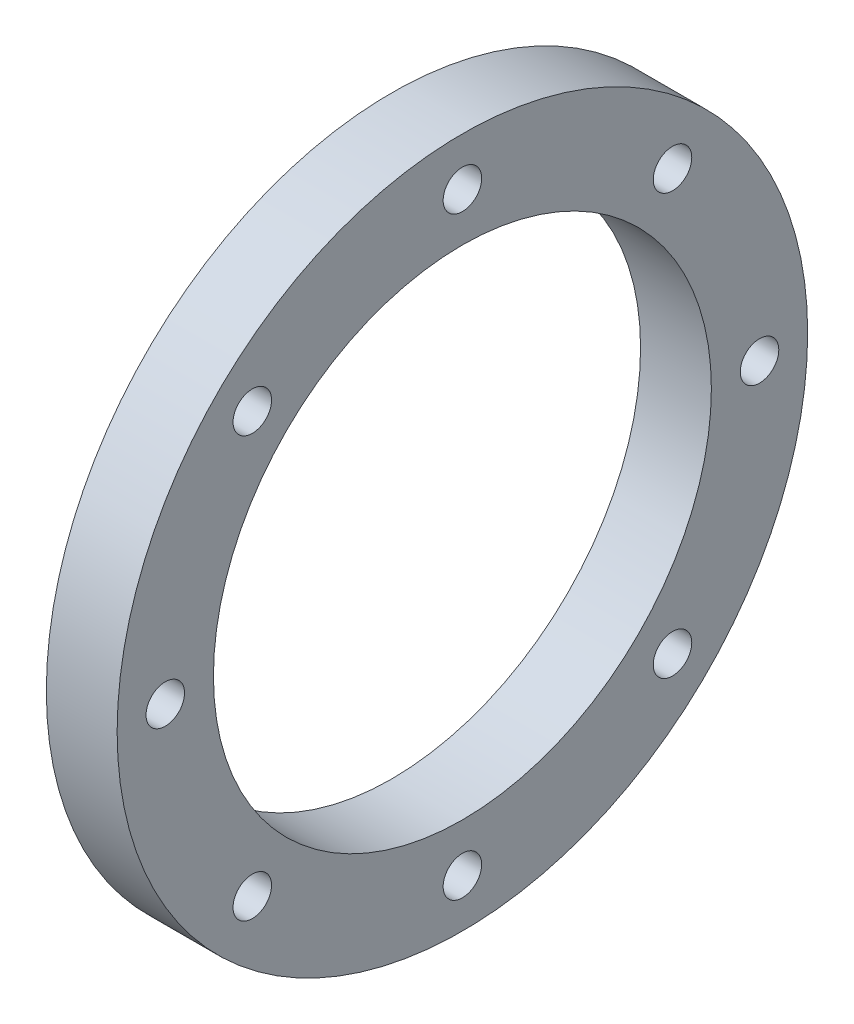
ISO-10303-21;
HEADER;
FILE_DESCRIPTION(('STEP AP214'),'2;1');
FILE_NAME('part.step','',(''),(''),'','','');
FILE_SCHEMA(('AUTOMOTIVE_DESIGN { 1 0 10303 214 1 1 1 1 }'));
ENDSEC;
DATA;
#1=APPLICATION_CONTEXT('core data for automotive mechanical design processes');
#2=APPLICATION_PROTOCOL_DEFINITION('international standard','automotive_design',2000,#1);
#3=PRODUCT_CONTEXT('',#1,'mechanical');
#4=PRODUCT('Part','Part','',(#3));
#5=PRODUCT_RELATED_PRODUCT_CATEGORY('part','',(#4));
#6=PRODUCT_DEFINITION_FORMATION('','',#4);
#7=PRODUCT_DEFINITION_CONTEXT('part definition',#1,'design');
#8=PRODUCT_DEFINITION('design','',#6,#7);
#9=PRODUCT_DEFINITION_SHAPE('','',#8);
#10=(LENGTH_UNIT() NAMED_UNIT(*) SI_UNIT(.MILLI.,.METRE.));
#11=(NAMED_UNIT(*) PLANE_ANGLE_UNIT() SI_UNIT($,.RADIAN.));
#12=(NAMED_UNIT(*) SI_UNIT($,.STERADIAN.) SOLID_ANGLE_UNIT());
#13=UNCERTAINTY_MEASURE_WITH_UNIT(LENGTH_MEASURE(1.E-05),#10,'distance_accuracy_value','');
#14=(GEOMETRIC_REPRESENTATION_CONTEXT(3) GLOBAL_UNCERTAINTY_ASSIGNED_CONTEXT((#13)) GLOBAL_UNIT_ASSIGNED_CONTEXT((#10,
#11,#12)) REPRESENTATION_CONTEXT('',''));
#15=CARTESIAN_POINT('',(0.,0.,0.));
#16=DIRECTION('',(0.,0.,1.));
#17=DIRECTION('',(1.,0.,0.));
#18=AXIS2_PLACEMENT_3D('',#15,#16,#17);
#19=CARTESIAN_POINT('',(-95.25,22.3266,0.));
#20=DIRECTION('',(-1.,0.,0.));
#21=DIRECTION('',(0.,0.,1.));
#22=AXIS2_PLACEMENT_3D('',#19,#20,#21);
#23=PLANE('',#22);
#24=CARTESIAN_POINT('',(-95.25,0.,26.6446));
#25=DIRECTION('',(1.,0.,0.));
#26=DIRECTION('',(0.,0.,-1.));
#27=AXIS2_PLACEMENT_3D('',#24,#25,#26);
#28=CIRCLE('',#27,1.72719999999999);
#29=CARTESIAN_POINT('',(-95.25,0.,24.9174));
#30=VERTEX_POINT('',#29);
#31=EDGE_CURVE('E99',#30,#30,#28,.T.);
#32=ORIENTED_EDGE('',*,*,#31,.T.);
#33=EDGE_LOOP('',(#32));
#34=FACE_BOUND('',#33,.T.);
#35=CARTESIAN_POINT('',(-95.25,18.840577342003,18.8405773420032));
#36=DIRECTION('',(1.,0.,0.));
#37=DIRECTION('',(0.,0.,-1.));
#38=AXIS2_PLACEMENT_3D('',#35,#36,#37);
#39=CIRCLE('',#38,1.72719999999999);
#40=CARTESIAN_POINT('',(-95.25,18.840577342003,17.1133773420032));
#41=VERTEX_POINT('',#40);
#42=EDGE_CURVE('E93',#41,#41,#39,.T.);
#43=ORIENTED_EDGE('',*,*,#42,.T.);
#44=EDGE_LOOP('',(#43));
#45=FACE_BOUND('',#44,.T.);
#46=CARTESIAN_POINT('',(-95.25,26.6445999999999,2.73872971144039E-13));
#47=DIRECTION('',(1.,0.,0.));
#48=DIRECTION('',(0.,0.,-1.));
#49=AXIS2_PLACEMENT_3D('',#46,#47,#48);
#50=CIRCLE('',#49,1.72719999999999);
#51=CARTESIAN_POINT('',(-95.25,26.6445999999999,-1.72719999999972));
#52=VERTEX_POINT('',#51);
#53=EDGE_CURVE('E87',#52,#52,#50,.T.);
#54=ORIENTED_EDGE('',*,*,#53,.T.);
#55=EDGE_LOOP('',(#54));
#56=FACE_BOUND('',#55,.T.);
#57=CARTESIAN_POINT('',(-95.25,18.8405773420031,-18.8405773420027));
#58=DIRECTION('',(1.,0.,0.));
#59=DIRECTION('',(0.,0.,-1.));
#60=AXIS2_PLACEMENT_3D('',#57,#58,#59);
#61=CIRCLE('',#60,1.72719999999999);
#62=CARTESIAN_POINT('',(-95.25,18.8405773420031,-20.5677773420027));
#63=VERTEX_POINT('',#62);
#64=EDGE_CURVE('E81',#63,#63,#61,.T.);
#65=ORIENTED_EDGE('',*,*,#64,.T.);
#66=EDGE_LOOP('',(#65));
#67=FACE_BOUND('',#66,.T.);
#68=CARTESIAN_POINT('',(-95.25,1.25710150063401E-13,-26.6445999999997));
#69=DIRECTION('',(1.,0.,0.));
#70=DIRECTION('',(0.,0.,-1.));
#71=AXIS2_PLACEMENT_3D('',#68,#69,#70);
#72=CIRCLE('',#71,1.72719999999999);
#73=CARTESIAN_POINT('',(-95.25,1.24943119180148E-13,-28.3717999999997));
#74=VERTEX_POINT('',#73);
#75=EDGE_CURVE('E75',#74,#74,#72,.T.);
#76=ORIENTED_EDGE('',*,*,#75,.T.);
#77=EDGE_LOOP('',(#76));
#78=FACE_BOUND('',#77,.T.);
#79=CARTESIAN_POINT('',(-95.25,-18.8405773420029,-18.8405773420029));
#80=DIRECTION('',(1.,0.,0.));
#81=DIRECTION('',(0.,0.,-1.));
#82=AXIS2_PLACEMENT_3D('',#79,#80,#81);
#83=CIRCLE('',#82,1.72719999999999);
#84=CARTESIAN_POINT('',(-95.25,-18.8405773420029,-20.5677773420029));
#85=VERTEX_POINT('',#84);
#86=EDGE_CURVE('E69',#85,#85,#83,.T.);
#87=ORIENTED_EDGE('',*,*,#86,.T.);
#88=EDGE_LOOP('',(#87));
#89=FACE_BOUND('',#88,.T.);
#90=CARTESIAN_POINT('',(-95.25,-26.6445999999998,0.));
#91=DIRECTION('',(1.,0.,0.));
#92=DIRECTION('',(0.,0.,-1.));
#93=AXIS2_PLACEMENT_3D('',#90,#91,#92);
#94=CIRCLE('',#93,1.72719999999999);
#95=CARTESIAN_POINT('',(-95.25,-26.6445999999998,-1.7271999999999));
#96=VERTEX_POINT('',#95);
#97=EDGE_CURVE('E63',#96,#96,#94,.T.);
#98=ORIENTED_EDGE('',*,*,#97,.T.);
#99=EDGE_LOOP('',(#98));
#100=FACE_BOUND('',#99,.T.);
#101=CARTESIAN_POINT('',(-95.25,-18.840577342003,18.8405773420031));
#102=DIRECTION('',(1.,0.,0.));
#103=DIRECTION('',(0.,0.,-1.));
#104=AXIS2_PLACEMENT_3D('',#101,#102,#103);
#105=CIRCLE('',#104,1.72719999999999);
#106=CARTESIAN_POINT('',(-95.25,-18.840577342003,17.1133773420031));
#107=VERTEX_POINT('',#106);
#108=EDGE_CURVE('E57',#107,#107,#105,.T.);
#109=ORIENTED_EDGE('',*,*,#108,.T.);
#110=EDGE_LOOP('',(#109));
#111=FACE_BOUND('',#110,.T.);
#112=CARTESIAN_POINT('',(-95.25,0.,0.));
#113=DIRECTION('',(1.,0.,0.));
#114=DIRECTION('',(0.,0.,-1.));
#115=AXIS2_PLACEMENT_3D('',#112,#113,#114);
#116=CIRCLE('',#115,22.3266);
#117=CARTESIAN_POINT('',(-95.25,0.,-22.3266));
#118=VERTEX_POINT('',#117);
#119=EDGE_CURVE('E49',#118,#118,#116,.T.);
#120=ORIENTED_EDGE('',*,*,#119,.T.);
#121=EDGE_LOOP('',(#120));
#122=FACE_BOUND('',#121,.T.);
#123=CARTESIAN_POINT('',(-95.25,0.,0.));
#124=DIRECTION('',(1.,0.,0.));
#125=DIRECTION('',(0.,0.,-1.));
#126=AXIS2_PLACEMENT_3D('',#123,#124,#125);
#127=CIRCLE('',#126,30.9626);
#128=CARTESIAN_POINT('',(-95.25,0.,-30.9626));
#129=VERTEX_POINT('',#128);
#130=EDGE_CURVE('E10',#129,#129,#127,.T.);
#131=ORIENTED_EDGE('',*,*,#130,.F.);
#132=EDGE_LOOP('',(#131));
#133=FACE_BOUND('',#132,.T.);
#134=ADVANCED_FACE('F35',(#34,#45,#56,#67,#78,#89,#100,#111,#122,#133),#23,.T.);
#135=CARTESIAN_POINT('',(0.,0.,0.));
#136=DIRECTION('',(1.,0.,0.));
#137=DIRECTION('',(0.,0.,-1.));
#138=AXIS2_PLACEMENT_3D('',#135,#136,#137);
#139=CYLINDRICAL_SURFACE('',#138,30.9626);
#140=ORIENTED_EDGE('',*,*,#130,.T.);
#141=EDGE_LOOP('',(#140));
#142=FACE_BOUND('',#141,.T.);
#143=CARTESIAN_POINT('',(-88.9,0.,0.));
#144=DIRECTION('',(1.,0.,0.));
#145=DIRECTION('',(0.,0.,-1.));
#146=AXIS2_PLACEMENT_3D('',#143,#144,#145);
#147=CIRCLE('',#146,30.9626);
#148=CARTESIAN_POINT('',(-88.9,0.,-30.9626));
#149=VERTEX_POINT('',#148);
#150=EDGE_CURVE('E41',#149,#149,#147,.T.);
#151=ORIENTED_EDGE('',*,*,#150,.F.);
#152=EDGE_LOOP('',(#151));
#153=FACE_BOUND('',#152,.T.);
#154=ADVANCED_FACE('F116',(#142,#153),#139,.T.);
#155=CARTESIAN_POINT('',(-88.9,22.3266,0.));
#156=DIRECTION('',(1.,0.,0.));
#157=DIRECTION('',(0.,0.,-1.));
#158=AXIS2_PLACEMENT_3D('',#155,#156,#157);
#159=PLANE('',#158);
#160=CARTESIAN_POINT('',(-88.9,0.,26.6446));
#161=DIRECTION('',(1.,0.,0.));
#162=DIRECTION('',(0.,0.,-1.));
#163=AXIS2_PLACEMENT_3D('',#160,#161,#162);
#164=CIRCLE('',#163,1.72719999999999);
#165=CARTESIAN_POINT('',(-88.9,0.,24.9174));
#166=VERTEX_POINT('',#165);
#167=EDGE_CURVE('E96',#166,#166,#164,.T.);
#168=ORIENTED_EDGE('',*,*,#167,.F.);
#169=EDGE_LOOP('',(#168));
#170=FACE_BOUND('',#169,.T.);
#171=CARTESIAN_POINT('',(-88.9,18.840577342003,18.8405773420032));
#172=DIRECTION('',(1.,0.,0.));
#173=DIRECTION('',(0.,0.,-1.));
#174=AXIS2_PLACEMENT_3D('',#171,#172,#173);
#175=CIRCLE('',#174,1.72719999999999);
#176=CARTESIAN_POINT('',(-88.9,18.840577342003,17.1133773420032));
#177=VERTEX_POINT('',#176);
#178=EDGE_CURVE('E90',#177,#177,#175,.T.);
#179=ORIENTED_EDGE('',*,*,#178,.F.);
#180=EDGE_LOOP('',(#179));
#181=FACE_BOUND('',#180,.T.);
#182=CARTESIAN_POINT('',(-88.9,26.6445999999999,2.73831529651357E-13));
#183=DIRECTION('',(1.,0.,0.));
#184=DIRECTION('',(0.,0.,-1.));
#185=AXIS2_PLACEMENT_3D('',#182,#183,#184);
#186=CIRCLE('',#185,1.72719999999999);
#187=CARTESIAN_POINT('',(-88.9,26.6445999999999,-1.72719999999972));
#188=VERTEX_POINT('',#187);
#189=EDGE_CURVE('E84',#188,#188,#186,.T.);
#190=ORIENTED_EDGE('',*,*,#189,.F.);
#191=EDGE_LOOP('',(#190));
#192=FACE_BOUND('',#191,.T.);
#193=CARTESIAN_POINT('',(-88.9,18.8405773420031,-18.8405773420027));
#194=DIRECTION('',(1.,0.,0.));
#195=DIRECTION('',(0.,0.,-1.));
#196=AXIS2_PLACEMENT_3D('',#193,#194,#195);
#197=CIRCLE('',#196,1.72719999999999);
#198=CARTESIAN_POINT('',(-88.9,18.8405773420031,-20.5677773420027));
#199=VERTEX_POINT('',#198);
#200=EDGE_CURVE('E78',#199,#199,#197,.T.);
#201=ORIENTED_EDGE('',*,*,#200,.F.);
#202=EDGE_LOOP('',(#201));
#203=FACE_BOUND('',#202,.T.);
#204=CARTESIAN_POINT('',(-88.9,1.20601220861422E-13,-26.6445999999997));
#205=DIRECTION('',(1.,0.,0.));
#206=DIRECTION('',(0.,0.,-1.));
#207=AXIS2_PLACEMENT_3D('',#204,#205,#206);
#208=CIRCLE('',#207,1.72719999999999);
#209=CARTESIAN_POINT('',(-88.9,1.19834189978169E-13,-28.3717999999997));
#210=VERTEX_POINT('',#209);
#211=EDGE_CURVE('E72',#210,#210,#208,.T.);
#212=ORIENTED_EDGE('',*,*,#211,.F.);
#213=EDGE_LOOP('',(#212));
#214=FACE_BOUND('',#213,.T.);
#215=CARTESIAN_POINT('',(-88.9,-18.8405773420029,-18.8405773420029));
#216=DIRECTION('',(1.,0.,0.));
#217=DIRECTION('',(0.,0.,-1.));
#218=AXIS2_PLACEMENT_3D('',#215,#216,#217);
#219=CIRCLE('',#218,1.72719999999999);
#220=CARTESIAN_POINT('',(-88.9,-18.8405773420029,-20.5677773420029));
#221=VERTEX_POINT('',#220);
#222=EDGE_CURVE('E66',#221,#221,#219,.T.);
#223=ORIENTED_EDGE('',*,*,#222,.F.);
#224=EDGE_LOOP('',(#223));
#225=FACE_BOUND('',#224,.T.);
#226=CARTESIAN_POINT('',(-88.9,-26.6445999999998,0.));
#227=DIRECTION('',(1.,0.,0.));
#228=DIRECTION('',(0.,0.,-1.));
#229=AXIS2_PLACEMENT_3D('',#226,#227,#228);
#230=CIRCLE('',#229,1.72719999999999);
#231=CARTESIAN_POINT('',(-88.9,-26.6445999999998,-1.72719999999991));
#232=VERTEX_POINT('',#231);
#233=EDGE_CURVE('E60',#232,#232,#230,.T.);
#234=ORIENTED_EDGE('',*,*,#233,.F.);
#235=EDGE_LOOP('',(#234));
#236=FACE_BOUND('',#235,.T.);
#237=CARTESIAN_POINT('',(-88.9,-18.840577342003,18.8405773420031));
#238=DIRECTION('',(1.,0.,0.));
#239=DIRECTION('',(0.,0.,-1.));
#240=AXIS2_PLACEMENT_3D('',#237,#238,#239);
#241=CIRCLE('',#240,1.72719999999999);
#242=CARTESIAN_POINT('',(-88.9,-18.840577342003,17.1133773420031));
#243=VERTEX_POINT('',#242);
#244=EDGE_CURVE('E54',#243,#243,#241,.T.);
#245=ORIENTED_EDGE('',*,*,#244,.F.);
#246=EDGE_LOOP('',(#245));
#247=FACE_BOUND('',#246,.T.);
#248=ORIENTED_EDGE('',*,*,#150,.T.);
#249=EDGE_LOOP('',(#248));
#250=FACE_BOUND('',#249,.T.);
#251=CARTESIAN_POINT('',(-88.9,0.,0.));
#252=DIRECTION('',(1.,0.,0.));
#253=DIRECTION('',(0.,0.,-1.));
#254=AXIS2_PLACEMENT_3D('',#251,#252,#253);
#255=CIRCLE('',#254,22.3266);
#256=CARTESIAN_POINT('',(-88.9,0.,-22.3266));
#257=VERTEX_POINT('',#256);
#258=EDGE_CURVE('E45',#257,#257,#255,.T.);
#259=ORIENTED_EDGE('',*,*,#258,.F.);
#260=EDGE_LOOP('',(#259));
#261=FACE_BOUND('',#260,.T.);
#262=ADVANCED_FACE('F112',(#170,#181,#192,#203,#214,#225,#236,#247,#250,#261),#159,.T.);
#263=CARTESIAN_POINT('',(0.,0.,0.));
#264=DIRECTION('',(1.,0.,0.));
#265=DIRECTION('',(0.,0.,-1.));
#266=AXIS2_PLACEMENT_3D('',#263,#264,#265);
#267=CYLINDRICAL_SURFACE('',#266,22.3266);
#268=ORIENTED_EDGE('',*,*,#258,.T.);
#269=EDGE_LOOP('',(#268));
#270=FACE_BOUND('',#269,.T.);
#271=ORIENTED_EDGE('',*,*,#119,.F.);
#272=EDGE_LOOP('',(#271));
#273=FACE_BOUND('',#272,.T.);
#274=ADVANCED_FACE('F115',(#270,#273),#267,.F.);
#275=CARTESIAN_POINT('',(-88.9,-18.840577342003,18.8405773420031));
#276=DIRECTION('',(1.,0.,0.));
#277=DIRECTION('',(0.,0.,-1.));
#278=AXIS2_PLACEMENT_3D('',#275,#276,#277);
#279=CYLINDRICAL_SURFACE('',#278,1.72719999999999);
#280=ORIENTED_EDGE('',*,*,#108,.F.);
#281=EDGE_LOOP('',(#280));
#282=FACE_BOUND('',#281,.T.);
#283=ORIENTED_EDGE('',*,*,#244,.T.);
#284=EDGE_LOOP('',(#283));
#285=FACE_BOUND('',#284,.T.);
#286=ADVANCED_FACE('F136',(#282,#285),#279,.F.);
#287=CARTESIAN_POINT('',(-88.9,-26.6445999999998,0.));
#288=DIRECTION('',(1.,0.,0.));
#289=DIRECTION('',(0.,0.,-1.));
#290=AXIS2_PLACEMENT_3D('',#287,#288,#289);
#291=CYLINDRICAL_SURFACE('',#290,1.72719999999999);
#292=ORIENTED_EDGE('',*,*,#97,.F.);
#293=EDGE_LOOP('',(#292));
#294=FACE_BOUND('',#293,.T.);
#295=ORIENTED_EDGE('',*,*,#233,.T.);
#296=EDGE_LOOP('',(#295));
#297=FACE_BOUND('',#296,.T.);
#298=ADVANCED_FACE('F151',(#294,#297),#291,.F.);
#299=CARTESIAN_POINT('',(-88.9,-18.8405773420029,-18.8405773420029));
#300=DIRECTION('',(1.,0.,0.));
#301=DIRECTION('',(0.,0.,-1.));
#302=AXIS2_PLACEMENT_3D('',#299,#300,#301);
#303=CYLINDRICAL_SURFACE('',#302,1.72719999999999);
#304=ORIENTED_EDGE('',*,*,#86,.F.);
#305=EDGE_LOOP('',(#304));
#306=FACE_BOUND('',#305,.T.);
#307=ORIENTED_EDGE('',*,*,#222,.T.);
#308=EDGE_LOOP('',(#307));
#309=FACE_BOUND('',#308,.T.);
#310=ADVANCED_FACE('F155',(#306,#309),#303,.F.);
#311=CARTESIAN_POINT('',(-88.9,1.20601220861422E-13,-26.6445999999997));
#312=DIRECTION('',(1.,0.,0.));
#313=DIRECTION('',(0.,0.,-1.));
#314=AXIS2_PLACEMENT_3D('',#311,#312,#313);
#315=CYLINDRICAL_SURFACE('',#314,1.72719999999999);
#316=ORIENTED_EDGE('',*,*,#75,.F.);
#317=EDGE_LOOP('',(#316));
#318=FACE_BOUND('',#317,.T.);
#319=ORIENTED_EDGE('',*,*,#211,.T.);
#320=EDGE_LOOP('',(#319));
#321=FACE_BOUND('',#320,.T.);
#322=ADVANCED_FACE('F159',(#318,#321),#315,.F.);
#323=CARTESIAN_POINT('',(-88.9,18.8405773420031,-18.8405773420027));
#324=DIRECTION('',(1.,0.,0.));
#325=DIRECTION('',(0.,0.,-1.));
#326=AXIS2_PLACEMENT_3D('',#323,#324,#325);
#327=CYLINDRICAL_SURFACE('',#326,1.72719999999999);
#328=ORIENTED_EDGE('',*,*,#64,.F.);
#329=EDGE_LOOP('',(#328));
#330=FACE_BOUND('',#329,.T.);
#331=ORIENTED_EDGE('',*,*,#200,.T.);
#332=EDGE_LOOP('',(#331));
#333=FACE_BOUND('',#332,.T.);
#334=ADVANCED_FACE('F163',(#330,#333),#327,.F.);
#335=CARTESIAN_POINT('',(-88.9,26.6445999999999,2.73831529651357E-13));
#336=DIRECTION('',(1.,0.,0.));
#337=DIRECTION('',(0.,0.,-1.));
#338=AXIS2_PLACEMENT_3D('',#335,#336,#337);
#339=CYLINDRICAL_SURFACE('',#338,1.72719999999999);
#340=ORIENTED_EDGE('',*,*,#53,.F.);
#341=EDGE_LOOP('',(#340));
#342=FACE_BOUND('',#341,.T.);
#343=ORIENTED_EDGE('',*,*,#189,.T.);
#344=EDGE_LOOP('',(#343));
#345=FACE_BOUND('',#344,.T.);
#346=ADVANCED_FACE('F167',(#342,#345),#339,.F.);
#347=CARTESIAN_POINT('',(-88.9,18.840577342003,18.8405773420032));
#348=DIRECTION('',(1.,0.,0.));
#349=DIRECTION('',(0.,0.,-1.));
#350=AXIS2_PLACEMENT_3D('',#347,#348,#349);
#351=CYLINDRICAL_SURFACE('',#350,1.72719999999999);
#352=ORIENTED_EDGE('',*,*,#42,.F.);
#353=EDGE_LOOP('',(#352));
#354=FACE_BOUND('',#353,.T.);
#355=ORIENTED_EDGE('',*,*,#178,.T.);
#356=EDGE_LOOP('',(#355));
#357=FACE_BOUND('',#356,.T.);
#358=ADVANCED_FACE('F108',(#354,#357),#351,.F.);
#359=CARTESIAN_POINT('',(-88.9,0.,26.6446));
#360=DIRECTION('',(1.,0.,0.));
#361=DIRECTION('',(0.,0.,-1.));
#362=AXIS2_PLACEMENT_3D('',#359,#360,#361);
#363=CYLINDRICAL_SURFACE('',#362,1.72719999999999);
#364=ORIENTED_EDGE('',*,*,#31,.F.);
#365=EDGE_LOOP('',(#364));
#366=FACE_BOUND('',#365,.T.);
#367=ORIENTED_EDGE('',*,*,#167,.T.);
#368=EDGE_LOOP('',(#367));
#369=FACE_BOUND('',#368,.T.);
#370=ADVANCED_FACE('F105',(#366,#369),#363,.F.);
#371=CLOSED_SHELL('',(#134,#154,#262,#274,#286,#298,#310,#322,#334,#346,#358,#370));
#372=MANIFOLD_SOLID_BREP('B2',#371);
#373=ADVANCED_BREP_SHAPE_REPRESENTATION('',(#18,#372),#14);
#374=SHAPE_DEFINITION_REPRESENTATION(#9,#373);
ENDSEC;
END-ISO-10303-21;
